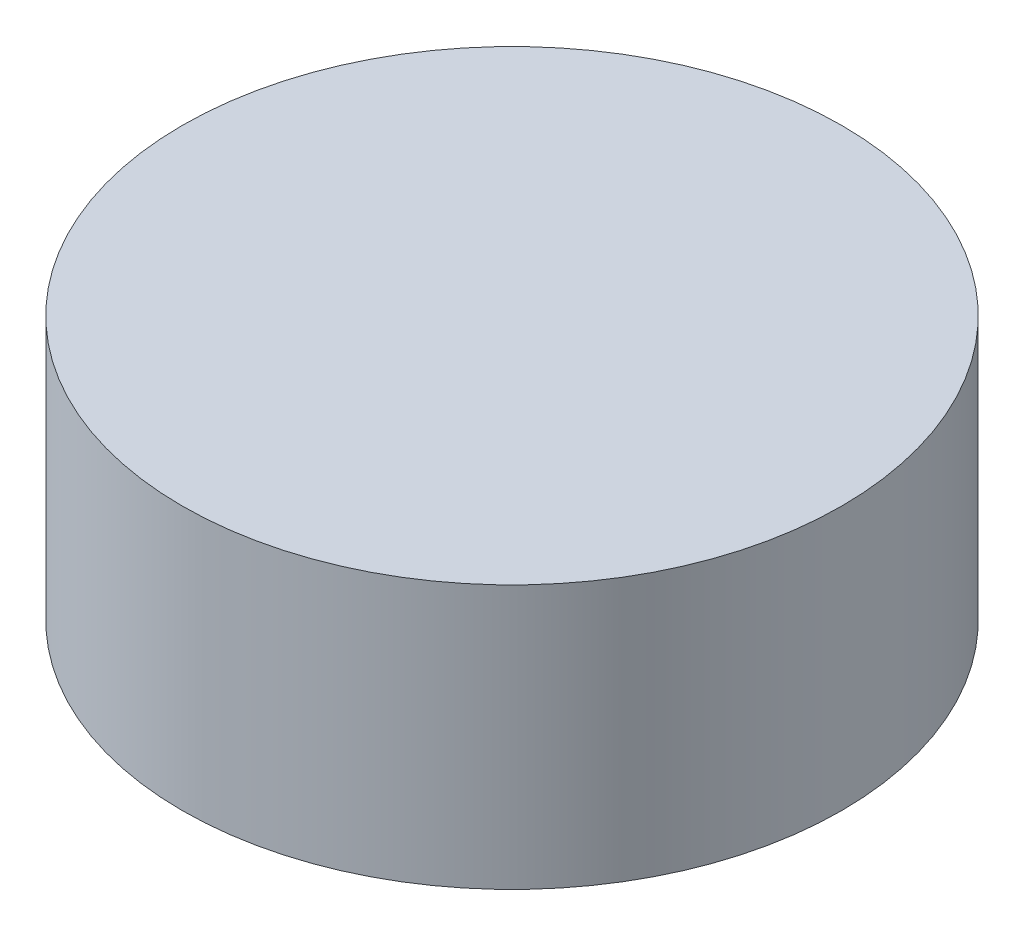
from build123d import *

# Parameters (mm, degrees)
SKETCH_1_R      = 35
SKETCH_1_R_2    = 30
EXTRUDE_1_DEPTH = 14
EXTRUDE_START   = -14
SKETCH_1_2_R    = 30
EXTRUDE_2_DEPTH = 5
EXTRUDE_START_2 = 9
SKETCH_1_3_R    = 30
EXTRUDE_3_DEPTH = 5


with BuildPart() as part:
    # Sketch 1 → Extrude 1 (new, symmetric)
    with BuildSketch(Plane(origin=(0, 0, 0), x_dir=(1, 0, 0), z_dir=(0, 1, 0))):
        with Locations(Location((0, 0, 0), (0, 0, 270))):
            Circle(SKETCH_1_R)
        with Locations(Location((0, 0, 0), (0, 0, 270))):
            Circle(SKETCH_1_R_2, mode=Mode.SUBTRACT)
    extrude(amount=EXTRUDE_1_DEPTH, both=True)

    # Sketch 1_2 → Extrude 2 (add)
    with BuildSketch(Plane(origin=(0, 0, 0), x_dir=(1, 0, 0), z_dir=(0, 1, 0)).offset(EXTRUDE_START)):
        with Locations(Location((0, 0, 0), (0, 0, 270))):
            Circle(SKETCH_1_2_R)
    extrude(amount=EXTRUDE_2_DEPTH)

    # Sketch 1_3 → Extrude 3 (add)
    with BuildSketch(Plane(origin=(0, 0, 0), x_dir=(1, 0, 0), z_dir=(0, 1, 0)).offset(EXTRUDE_START_2)):
        with Locations(Location((0, 0, 0), (0, 0, 270))):
            Circle(SKETCH_1_3_R)
    extrude(amount=EXTRUDE_3_DEPTH)


solid = part.part
